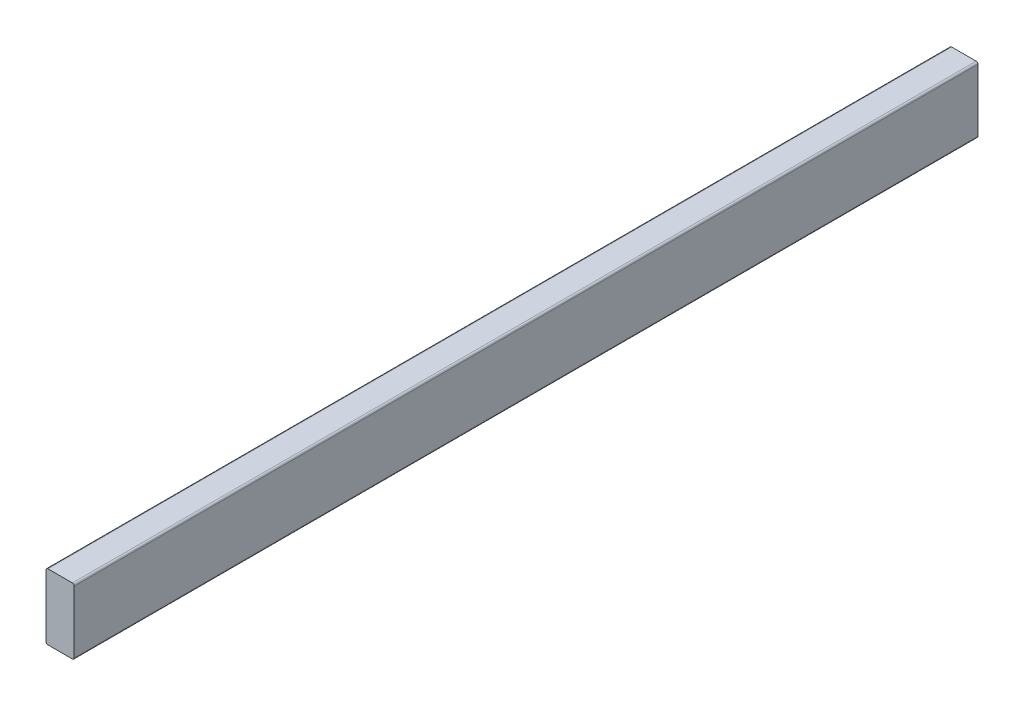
from build123d import *

# Parameters (mm, degrees)
SKETCH1_W           = 38.1
SKETCH1_H           = 88.9
BOSS_EXTRUDE1_DEPTH = 609.6
FILLET1_R           = 2.54


with BuildPart() as part:
    # Sketch1 → Boss-Extrude1 (new, symmetric)
    with BuildSketch(Plane.XY):
        Rectangle(SKETCH1_W, SKETCH1_H)
    extrude(amount=BOSS_EXTRUDE1_DEPTH, both=True)

    # Fillet1
    fillet1_edges = [part.edges().sort_by_distance(p)[0] for p in [
        (19.05, -44.45, 0),
        (-19.05, -44.45, 0),
        (-19.05, 44.45, 0),
        (19.05, 44.45, 0),
    ]]
    fillet(fillet1_edges, radius=FILLET1_R)


solid = part.part
